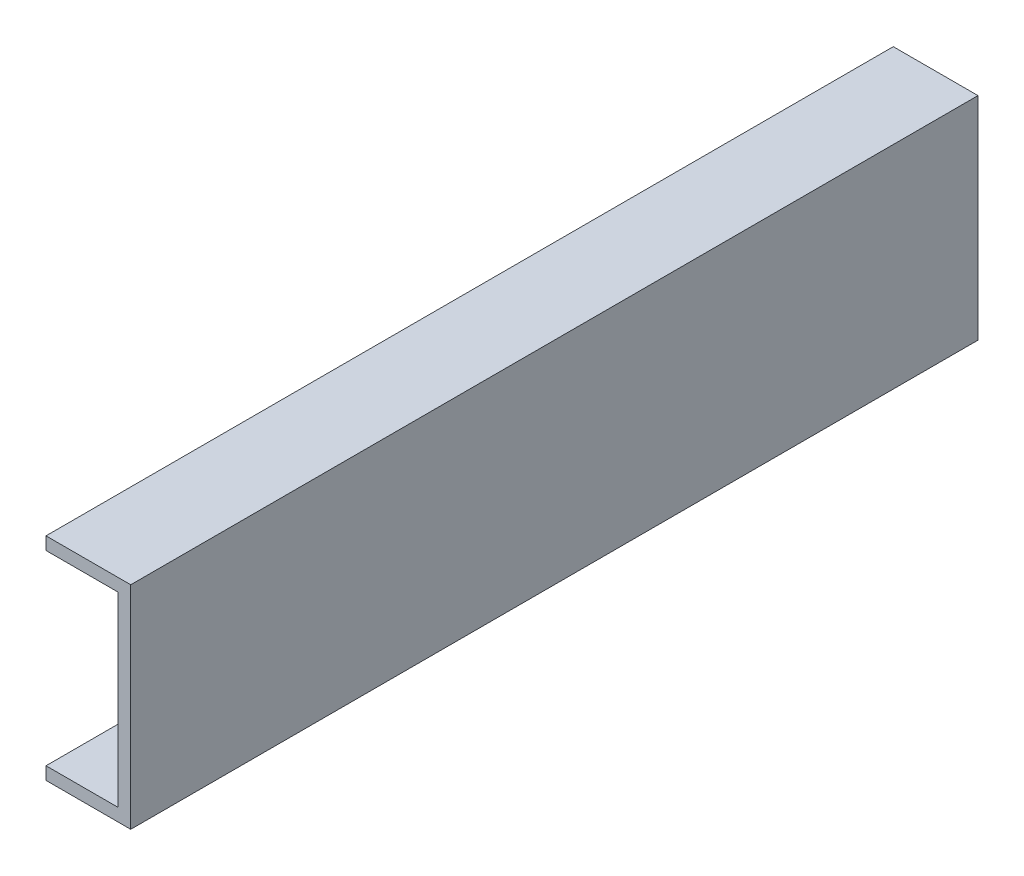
from build123d import *

# Parameters (mm, degrees)
LINEAR_AUSTRAGEN_D_NN1_DEPTH = 200


with BuildPart() as part:
    # Skizze1 → Linear-Austragen-D_nn1 (new body)
    with BuildSketch(Plane.XY):
        Polygon((-20, 25), (0, 25), (0, -25), (-20, -25), (-20, -22), (-3, -22), (-3, 22), (-20, 22), align=None)
    extrude(amount=LINEAR_AUSTRAGEN_D_NN1_DEPTH)


solid = part.part
